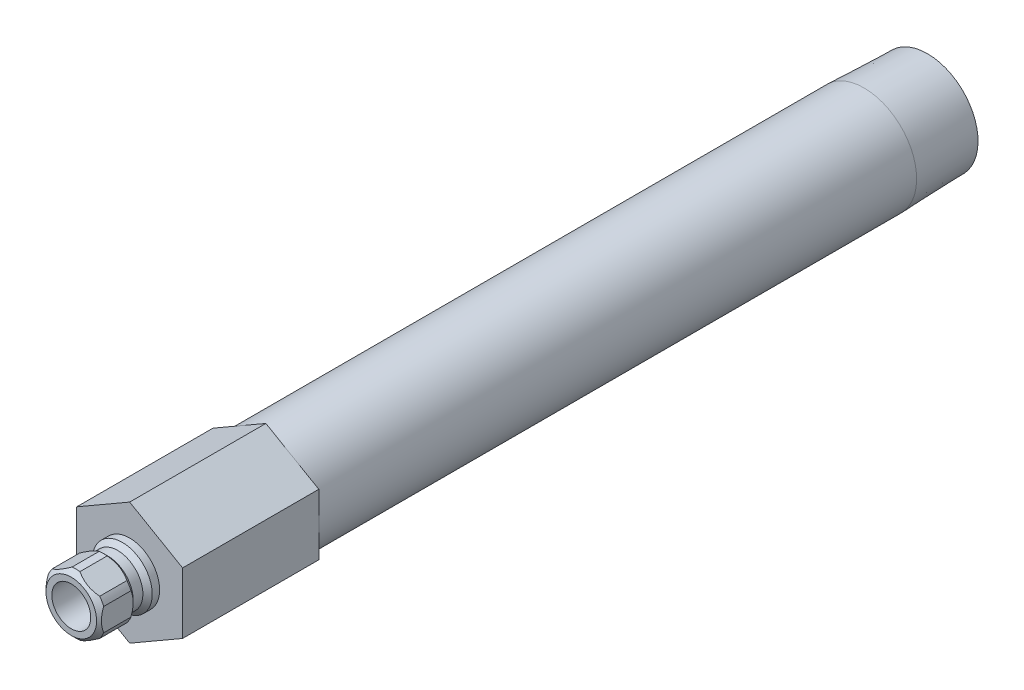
from build123d import *

# Parameters (mm, degrees)
SKETCH2_R           = 3.175
BOSS_EXTRUDE1_DEPTH = 22.225
CUT_EXTRUDE1_START  = 3.556
SKETCH3_OUTSIDE_W   = 47.706
SKETCH3_OUTSIDE_H   = 50.378
CUT_EXTRUDE1_DEPTH  = 128.285705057


with BuildPart() as part:
    # Sketch1 → Revolve1 (revolve)
    with BuildSketch(Plane(origin=(0, 0, 0), x_dir=(0, 0, -1), z_dir=(1, 0, 0))):
        Polygon((-9.525, 3.175), (-9.525, 4.1275), (-8.763, 4.8895), (-4.318, 4.8895), (-3.556, 4.1275), (-1.9685, 4.1275), (-1.2065, 4.8895), (0, 4.8895), (0, 8.5725), (119.8372, 8.5725), (130.175, 8.249445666), (130.175, 6.2611), (22.225, 6.2611), (22.225, 3.175), align=None)
    revolve(axis=Axis((0, 0, 0), (0, 0, 1)))

    # Sketch2 → Boss-Extrude1 (add)
    with BuildSketch(Plane.XY):
        Polygon((-8.636, 4.985996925), (-8.636, -4.985996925), (0, -9.971993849), (8.636, -4.985996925), (8.636, 4.985996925), (0, 9.971993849), align=None)
        with Locations(Location((0, 0, 0), (0, 0, 90))):
            Circle(SKETCH2_R, mode=Mode.SUBTRACT)
    extrude(amount=-BOSS_EXTRUDE1_DEPTH)

    # Sketch3 outside → Cut-Extrude1 (cut, through all)
    with BuildSketch(Plane.XY.offset(CUT_EXTRUDE1_START)):
        Rectangle(SKETCH3_OUTSIDE_W, SKETCH3_OUTSIDE_H)
        Polygon((4.5212, 2.610316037), (0, 5.220632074), (-4.5212, 2.610316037), (-4.5212, -2.610316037), (0, -5.220632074), (4.5212, -2.610316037), align=None, mode=Mode.SUBTRACT)
    extrude(amount=CUT_EXTRUDE1_DEPTH, mode=Mode.SUBTRACT)


solid = part.part
